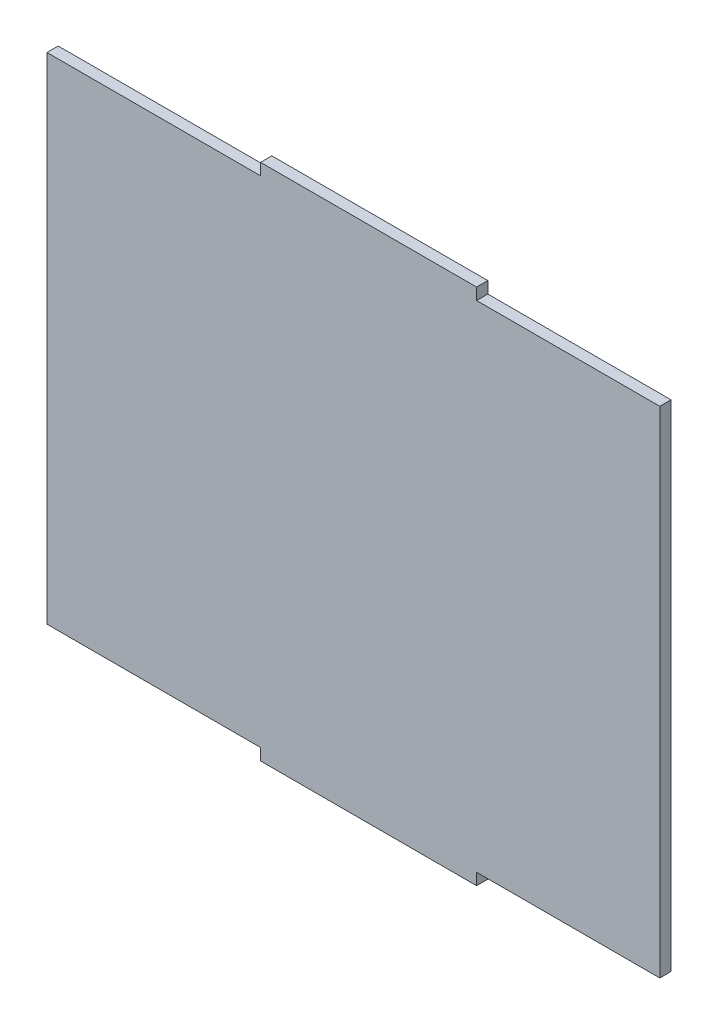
ISO-10303-21;
HEADER;
FILE_DESCRIPTION(('STEP AP214'),'2;1');
FILE_NAME('part.step','',(''),(''),'','','');
FILE_SCHEMA(('AUTOMOTIVE_DESIGN { 1 0 10303 214 1 1 1 1 }'));
ENDSEC;
DATA;
#1=APPLICATION_CONTEXT('core data for automotive mechanical design processes');
#2=APPLICATION_PROTOCOL_DEFINITION('international standard','automotive_design',2000,#1);
#3=PRODUCT_CONTEXT('',#1,'mechanical');
#4=PRODUCT('Part','Part','',(#3));
#5=PRODUCT_RELATED_PRODUCT_CATEGORY('part','',(#4));
#6=PRODUCT_DEFINITION_FORMATION('','',#4);
#7=PRODUCT_DEFINITION_CONTEXT('part definition',#1,'design');
#8=PRODUCT_DEFINITION('design','',#6,#7);
#9=PRODUCT_DEFINITION_SHAPE('','',#8);
#10=(LENGTH_UNIT() NAMED_UNIT(*) SI_UNIT(.MILLI.,.METRE.));
#11=(NAMED_UNIT(*) PLANE_ANGLE_UNIT() SI_UNIT($,.RADIAN.));
#12=(NAMED_UNIT(*) SI_UNIT($,.STERADIAN.) SOLID_ANGLE_UNIT());
#13=UNCERTAINTY_MEASURE_WITH_UNIT(LENGTH_MEASURE(1.E-05),#10,'distance_accuracy_value','');
#14=(GEOMETRIC_REPRESENTATION_CONTEXT(3) GLOBAL_UNCERTAINTY_ASSIGNED_CONTEXT((#13)) GLOBAL_UNIT_ASSIGNED_CONTEXT((#10,
#11,#12)) REPRESENTATION_CONTEXT('',''));
#15=CARTESIAN_POINT('',(0.,0.,0.));
#16=DIRECTION('',(0.,0.,1.));
#17=DIRECTION('',(1.,0.,0.));
#18=AXIS2_PLACEMENT_3D('',#15,#16,#17);
#19=CARTESIAN_POINT('',(103.2781641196,75.1243500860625,2.6));
#20=DIRECTION('',(-1.,0.,0.));
#21=DIRECTION('',(0.,-1.,0.));
#22=AXIS2_PLACEMENT_3D('',#19,#20,#21);
#23=PLANE('',#22);
#24=DIRECTION('',(0.,1.,0.));
#25=VECTOR('',#24,1.);
#26=CARTESIAN_POINT('',(103.2781641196,75.1243500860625,0.));
#27=LINE('',#26,#25);
#28=CARTESIAN_POINT('',(103.2781641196,-39.4756499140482,0.));
#29=VERTEX_POINT('',#28);
#30=CARTESIAN_POINT('',(103.2781641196,75.1243500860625,0.));
#31=VERTEX_POINT('',#30);
#32=EDGE_CURVE('E157',#29,#31,#27,.T.);
#33=ORIENTED_EDGE('',*,*,#32,.T.);
#34=DIRECTION('',(0.,0.,-1.));
#35=VECTOR('',#34,1.);
#36=CARTESIAN_POINT('',(103.2781641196,75.1243500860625,2.6));
#37=LINE('',#36,#35);
#38=CARTESIAN_POINT('',(103.2781641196,75.1243500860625,2.6));
#39=VERTEX_POINT('',#38);
#40=EDGE_CURVE('E45',#39,#31,#37,.T.);
#41=ORIENTED_EDGE('',*,*,#40,.F.);
#42=DIRECTION('',(0.,1.,0.));
#43=VECTOR('',#42,1.);
#44=CARTESIAN_POINT('',(103.2781641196,75.1243500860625,2.6));
#45=LINE('',#44,#43);
#46=CARTESIAN_POINT('',(103.2781641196,-39.4756499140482,2.6));
#47=VERTEX_POINT('',#46);
#48=EDGE_CURVE('E209',#47,#39,#45,.T.);
#49=ORIENTED_EDGE('',*,*,#48,.F.);
#50=DIRECTION('',(0.,0.,-1.));
#51=VECTOR('',#50,1.);
#52=CARTESIAN_POINT('',(103.2781641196,-39.4756499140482,2.6));
#53=LINE('',#52,#51);
#54=EDGE_CURVE('E11',#47,#29,#53,.T.);
#55=ORIENTED_EDGE('',*,*,#54,.T.);
#56=EDGE_LOOP('',(#33,#41,#49,#55));
#57=FACE_BOUND('',#56,.T.);
#58=ADVANCED_FACE('F37',(#57),#23,.F.);
#59=CARTESIAN_POINT('',(60.8771144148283,75.1243500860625,2.6));
#60=DIRECTION('',(0.,-1.,0.));
#61=DIRECTION('',(0.,0.,-1.));
#62=AXIS2_PLACEMENT_3D('',#59,#60,#61);
#63=PLANE('',#62);
#64=DIRECTION('',(-1.,0.,0.));
#65=VECTOR('',#64,1.);
#66=CARTESIAN_POINT('',(60.8771144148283,75.1243500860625,0.));
#67=LINE('',#66,#65);
#68=CARTESIAN_POINT('',(60.8771144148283,75.1243500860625,0.));
#69=VERTEX_POINT('',#68);
#70=EDGE_CURVE('E160',#31,#69,#67,.T.);
#71=ORIENTED_EDGE('',*,*,#70,.T.);
#72=DIRECTION('',(0.,0.,-1.));
#73=VECTOR('',#72,1.);
#74=CARTESIAN_POINT('',(60.8771144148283,75.1243500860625,2.6));
#75=LINE('',#74,#73);
#76=CARTESIAN_POINT('',(60.8771144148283,75.1243500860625,2.6));
#77=VERTEX_POINT('',#76);
#78=EDGE_CURVE('E198',#77,#69,#75,.T.);
#79=ORIENTED_EDGE('',*,*,#78,.F.);
#80=DIRECTION('',(-1.,0.,0.));
#81=VECTOR('',#80,1.);
#82=CARTESIAN_POINT('',(93.369435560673,75.1243500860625,2.6));
#83=LINE('',#82,#81);
#84=EDGE_CURVE('E206',#39,#77,#83,.T.);
#85=ORIENTED_EDGE('',*,*,#84,.F.);
#86=ORIENTED_EDGE('',*,*,#40,.T.);
#87=EDGE_LOOP('',(#71,#79,#85,#86));
#88=FACE_BOUND('',#87,.T.);
#89=ADVANCED_FACE('F204',(#88),#63,.F.);
#90=CARTESIAN_POINT('',(60.8771144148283,77.8243500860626,2.6));
#91=DIRECTION('',(-1.,0.,0.));
#92=DIRECTION('',(0.,0.,1.));
#93=AXIS2_PLACEMENT_3D('',#90,#91,#92);
#94=PLANE('',#93);
#95=DIRECTION('',(0.,1.,0.));
#96=VECTOR('',#95,1.);
#97=CARTESIAN_POINT('',(60.8771144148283,77.8243500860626,0.));
#98=LINE('',#97,#96);
#99=CARTESIAN_POINT('',(60.8771144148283,77.8243500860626,0.));
#100=VERTEX_POINT('',#99);
#101=EDGE_CURVE('E162',#69,#100,#98,.T.);
#102=ORIENTED_EDGE('',*,*,#101,.T.);
#103=DIRECTION('',(0.,0.,-1.));
#104=VECTOR('',#103,1.);
#105=CARTESIAN_POINT('',(60.8771144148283,77.8243500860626,2.6));
#106=LINE('',#105,#104);
#107=CARTESIAN_POINT('',(60.8771144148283,77.8243500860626,2.6));
#108=VERTEX_POINT('',#107);
#109=EDGE_CURVE('E195',#108,#100,#106,.T.);
#110=ORIENTED_EDGE('',*,*,#109,.F.);
#111=DIRECTION('',(0.,1.,0.));
#112=VECTOR('',#111,1.);
#113=CARTESIAN_POINT('',(60.8771144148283,77.8243500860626,2.6));
#114=LINE('',#113,#112);
#115=EDGE_CURVE('E228',#77,#108,#114,.T.);
#116=ORIENTED_EDGE('',*,*,#115,.F.);
#117=ORIENTED_EDGE('',*,*,#78,.T.);
#118=EDGE_LOOP('',(#102,#110,#116,#117));
#119=FACE_BOUND('',#118,.T.);
#120=ADVANCED_FACE('F219',(#119),#94,.F.);
#121=CARTESIAN_POINT('',(60.8771144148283,77.8243500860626,2.6));
#122=DIRECTION('',(0.,-1.,0.));
#123=DIRECTION('',(0.,0.,-1.));
#124=AXIS2_PLACEMENT_3D('',#121,#122,#123);
#125=PLANE('',#124);
#126=DIRECTION('',(-1.,0.,0.));
#127=VECTOR('',#126,1.);
#128=CARTESIAN_POINT('',(60.8771144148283,77.8243500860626,0.));
#129=LINE('',#128,#127);
#130=CARTESIAN_POINT('',(10.8771144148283,77.8243500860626,0.));
#131=VERTEX_POINT('',#130);
#132=EDGE_CURVE('E164',#100,#131,#129,.T.);
#133=ORIENTED_EDGE('',*,*,#132,.T.);
#134=DIRECTION('',(0.,0.,-1.));
#135=VECTOR('',#134,1.);
#136=CARTESIAN_POINT('',(10.8771144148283,77.8243500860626,2.6));
#137=LINE('',#136,#135);
#138=CARTESIAN_POINT('',(10.8771144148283,77.8243500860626,2.6));
#139=VERTEX_POINT('',#138);
#140=EDGE_CURVE('E192',#139,#131,#137,.T.);
#141=ORIENTED_EDGE('',*,*,#140,.F.);
#142=DIRECTION('',(-1.,0.,0.));
#143=VECTOR('',#142,1.);
#144=CARTESIAN_POINT('',(60.8771144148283,77.8243500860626,2.6));
#145=LINE('',#144,#143);
#146=EDGE_CURVE('E225',#108,#139,#145,.T.);
#147=ORIENTED_EDGE('',*,*,#146,.F.);
#148=ORIENTED_EDGE('',*,*,#109,.T.);
#149=EDGE_LOOP('',(#133,#141,#147,#148));
#150=FACE_BOUND('',#149,.T.);
#151=ADVANCED_FACE('F223',(#150),#125,.F.);
#152=CARTESIAN_POINT('',(10.8771144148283,77.8243500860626,2.6));
#153=DIRECTION('',(1.,0.,0.));
#154=DIRECTION('',(0.,0.,-1.));
#155=AXIS2_PLACEMENT_3D('',#152,#153,#154);
#156=PLANE('',#155);
#157=DIRECTION('',(0.,-1.,0.));
#158=VECTOR('',#157,1.);
#159=CARTESIAN_POINT('',(10.8771144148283,77.8243500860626,0.));
#160=LINE('',#159,#158);
#161=CARTESIAN_POINT('',(10.8771144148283,75.1243500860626,0.));
#162=VERTEX_POINT('',#161);
#163=EDGE_CURVE('E166',#131,#162,#160,.T.);
#164=ORIENTED_EDGE('',*,*,#163,.T.);
#165=DIRECTION('',(0.,0.,-1.));
#166=VECTOR('',#165,1.);
#167=CARTESIAN_POINT('',(10.8771144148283,75.1243500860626,2.6));
#168=LINE('',#167,#166);
#169=CARTESIAN_POINT('',(10.8771144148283,75.1243500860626,2.6));
#170=VERTEX_POINT('',#169);
#171=EDGE_CURVE('E189',#170,#162,#168,.T.);
#172=ORIENTED_EDGE('',*,*,#171,.F.);
#173=DIRECTION('',(0.,-1.,0.));
#174=VECTOR('',#173,1.);
#175=CARTESIAN_POINT('',(10.8771144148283,77.8243500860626,2.6));
#176=LINE('',#175,#174);
#177=EDGE_CURVE('E227',#139,#170,#176,.T.);
#178=ORIENTED_EDGE('',*,*,#177,.F.);
#179=ORIENTED_EDGE('',*,*,#140,.T.);
#180=EDGE_LOOP('',(#164,#172,#178,#179));
#181=FACE_BOUND('',#180,.T.);
#182=ADVANCED_FACE('F251',(#181),#156,.F.);
#183=CARTESIAN_POINT('',(-38.5603309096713,75.1243500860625,2.6));
#184=DIRECTION('',(0.,-1.,0.));
#185=DIRECTION('',(1.,0.,0.));
#186=AXIS2_PLACEMENT_3D('',#183,#184,#185);
#187=PLANE('',#186);
#188=DIRECTION('',(-1.,0.,0.));
#189=VECTOR('',#188,1.);
#190=CARTESIAN_POINT('',(-38.5603309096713,75.1243500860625,0.));
#191=LINE('',#190,#189);
#192=CARTESIAN_POINT('',(-38.5603309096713,75.1243500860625,0.));
#193=VERTEX_POINT('',#192);
#194=EDGE_CURVE('E168',#162,#193,#191,.T.);
#195=ORIENTED_EDGE('',*,*,#194,.T.);
#196=DIRECTION('',(0.,0.,-1.));
#197=VECTOR('',#196,1.);
#198=CARTESIAN_POINT('',(-38.5603309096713,75.1243500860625,2.6));
#199=LINE('',#198,#197);
#200=CARTESIAN_POINT('',(-38.5603309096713,75.1243500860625,2.6));
#201=VERTEX_POINT('',#200);
#202=EDGE_CURVE('E186',#201,#193,#199,.T.);
#203=ORIENTED_EDGE('',*,*,#202,.F.);
#204=DIRECTION('',(-1.,0.,0.));
#205=VECTOR('',#204,1.);
#206=CARTESIAN_POINT('',(-38.5603309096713,75.1243500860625,2.6));
#207=LINE('',#206,#205);
#208=EDGE_CURVE('E230',#170,#201,#207,.T.);
#209=ORIENTED_EDGE('',*,*,#208,.F.);
#210=ORIENTED_EDGE('',*,*,#171,.T.);
#211=EDGE_LOOP('',(#195,#203,#209,#210));
#212=FACE_BOUND('',#211,.T.);
#213=ADVANCED_FACE('F248',(#212),#187,.F.);
#214=CARTESIAN_POINT('',(-38.5603309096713,-39.4756499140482,2.6));
#215=DIRECTION('',(1.,0.,0.));
#216=DIRECTION('',(0.,0.,-1.));
#217=AXIS2_PLACEMENT_3D('',#214,#215,#216);
#218=PLANE('',#217);
#219=DIRECTION('',(0.,-1.,0.));
#220=VECTOR('',#219,1.);
#221=CARTESIAN_POINT('',(-38.5603309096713,-39.4756499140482,0.));
#222=LINE('',#221,#220);
#223=CARTESIAN_POINT('',(-38.5603309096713,-39.4756499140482,0.));
#224=VERTEX_POINT('',#223);
#225=EDGE_CURVE('E171',#193,#224,#222,.T.);
#226=ORIENTED_EDGE('',*,*,#225,.T.);
#227=DIRECTION('',(0.,0.,-1.));
#228=VECTOR('',#227,1.);
#229=CARTESIAN_POINT('',(-38.5603309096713,-39.4756499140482,2.6));
#230=LINE('',#229,#228);
#231=CARTESIAN_POINT('',(-38.5603309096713,-39.4756499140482,2.6));
#232=VERTEX_POINT('',#231);
#233=EDGE_CURVE('E183',#232,#224,#230,.T.);
#234=ORIENTED_EDGE('',*,*,#233,.F.);
#235=DIRECTION('',(0.,-1.,0.));
#236=VECTOR('',#235,1.);
#237=CARTESIAN_POINT('',(-38.5603309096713,39.4756499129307,2.6));
#238=LINE('',#237,#236);
#239=EDGE_CURVE('E236',#201,#232,#238,.T.);
#240=ORIENTED_EDGE('',*,*,#239,.F.);
#241=ORIENTED_EDGE('',*,*,#202,.T.);
#242=EDGE_LOOP('',(#226,#234,#240,#241));
#243=FACE_BOUND('',#242,.T.);
#244=ADVANCED_FACE('F242',(#243),#218,.F.);
#245=CARTESIAN_POINT('',(10.8771144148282,-39.4756499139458,2.6));
#246=DIRECTION('',(-2.07209110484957E-12,1.,0.));
#247=DIRECTION('',(-1.,-2.07209110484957E-12,0.));
#248=AXIS2_PLACEMENT_3D('',#245,#246,#247);
#249=PLANE('',#248);
#250=DIRECTION('',(1.,2.07209110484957E-12,0.));
#251=VECTOR('',#250,1.);
#252=CARTESIAN_POINT('',(10.8771144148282,-39.4756499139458,0.));
#253=LINE('',#252,#251);
#254=CARTESIAN_POINT('',(10.8771144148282,-39.4756499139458,0.));
#255=VERTEX_POINT('',#254);
#256=EDGE_CURVE('E173',#224,#255,#253,.T.);
#257=ORIENTED_EDGE('',*,*,#256,.T.);
#258=DIRECTION('',(0.,0.,-1.));
#259=VECTOR('',#258,1.);
#260=CARTESIAN_POINT('',(10.8771144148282,-39.4756499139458,2.6));
#261=LINE('',#260,#259);
#262=CARTESIAN_POINT('',(10.8771144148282,-39.4756499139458,2.6));
#263=VERTEX_POINT('',#262);
#264=EDGE_CURVE('E146',#263,#255,#261,.T.);
#265=ORIENTED_EDGE('',*,*,#264,.F.);
#266=DIRECTION('',(1.,2.07209110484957E-12,0.));
#267=VECTOR('',#266,1.);
#268=CARTESIAN_POINT('',(10.8771144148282,-39.4756499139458,2.6));
#269=LINE('',#268,#267);
#270=EDGE_CURVE('E137',#232,#263,#269,.T.);
#271=ORIENTED_EDGE('',*,*,#270,.F.);
#272=ORIENTED_EDGE('',*,*,#233,.T.);
#273=EDGE_LOOP('',(#257,#265,#271,#272));
#274=FACE_BOUND('',#273,.T.);
#275=ADVANCED_FACE('F245',(#274),#249,.F.);
#276=CARTESIAN_POINT('',(10.8771144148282,-39.4756499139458,2.6));
#277=DIRECTION('',(1.,0.,0.));
#278=DIRECTION('',(0.,0.,-1.));
#279=AXIS2_PLACEMENT_3D('',#276,#277,#278);
#280=PLANE('',#279);
#281=DIRECTION('',(0.,-1.,0.));
#282=VECTOR('',#281,1.);
#283=CARTESIAN_POINT('',(10.8771144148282,-39.4756499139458,0.));
#284=LINE('',#283,#282);
#285=CARTESIAN_POINT('',(10.8771144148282,-42.1756499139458,0.));
#286=VERTEX_POINT('',#285);
#287=EDGE_CURVE('E145',#255,#286,#284,.T.);
#288=ORIENTED_EDGE('',*,*,#287,.T.);
#289=DIRECTION('',(0.,0.,-1.));
#290=VECTOR('',#289,1.);
#291=CARTESIAN_POINT('',(10.8771144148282,-42.1756499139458,2.6));
#292=LINE('',#291,#290);
#293=CARTESIAN_POINT('',(10.8771144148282,-42.1756499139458,2.6));
#294=VERTEX_POINT('',#293);
#295=EDGE_CURVE('E142',#294,#286,#292,.T.);
#296=ORIENTED_EDGE('',*,*,#295,.F.);
#297=DIRECTION('',(0.,-1.,0.));
#298=VECTOR('',#297,1.);
#299=CARTESIAN_POINT('',(10.8771144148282,-39.4756499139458,2.6));
#300=LINE('',#299,#298);
#301=EDGE_CURVE('E131',#263,#294,#300,.T.);
#302=ORIENTED_EDGE('',*,*,#301,.F.);
#303=ORIENTED_EDGE('',*,*,#264,.T.);
#304=EDGE_LOOP('',(#288,#296,#302,#303));
#305=FACE_BOUND('',#304,.T.);
#306=ADVANCED_FACE('F143',(#305),#280,.F.);
#307=CARTESIAN_POINT('',(10.8771144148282,-42.1756499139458,2.6));
#308=DIRECTION('',(0.,1.,0.));
#309=DIRECTION('',(0.,0.,1.));
#310=AXIS2_PLACEMENT_3D('',#307,#308,#309);
#311=PLANE('',#310);
#312=DIRECTION('',(1.,0.,0.));
#313=VECTOR('',#312,1.);
#314=CARTESIAN_POINT('',(10.8771144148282,-42.1756499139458,0.));
#315=LINE('',#314,#313);
#316=CARTESIAN_POINT('',(60.8771144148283,-42.1756499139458,0.));
#317=VERTEX_POINT('',#316);
#318=EDGE_CURVE('E95',#286,#317,#315,.T.);
#319=ORIENTED_EDGE('',*,*,#318,.T.);
#320=DIRECTION('',(0.,0.,-1.));
#321=VECTOR('',#320,1.);
#322=CARTESIAN_POINT('',(60.8771144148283,-42.1756499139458,2.6));
#323=LINE('',#322,#321);
#324=CARTESIAN_POINT('',(60.8771144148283,-42.1756499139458,2.6));
#325=VERTEX_POINT('',#324);
#326=EDGE_CURVE('E147',#325,#317,#323,.T.);
#327=ORIENTED_EDGE('',*,*,#326,.F.);
#328=DIRECTION('',(1.,0.,0.));
#329=VECTOR('',#328,1.);
#330=CARTESIAN_POINT('',(10.8771144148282,-42.1756499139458,2.6));
#331=LINE('',#330,#329);
#332=EDGE_CURVE('E135',#294,#325,#331,.T.);
#333=ORIENTED_EDGE('',*,*,#332,.F.);
#334=ORIENTED_EDGE('',*,*,#295,.T.);
#335=EDGE_LOOP('',(#319,#327,#333,#334));
#336=FACE_BOUND('',#335,.T.);
#337=ADVANCED_FACE('F149',(#336),#311,.F.);
#338=CARTESIAN_POINT('',(60.8771144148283,-39.4756499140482,2.6));
#339=DIRECTION('',(-1.,0.,0.));
#340=DIRECTION('',(0.,-1.,0.));
#341=AXIS2_PLACEMENT_3D('',#338,#339,#340);
#342=PLANE('',#341);
#343=DIRECTION('',(0.,1.,0.));
#344=VECTOR('',#343,1.);
#345=CARTESIAN_POINT('',(60.8771144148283,-39.4756499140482,0.));
#346=LINE('',#345,#344);
#347=CARTESIAN_POINT('',(60.8771144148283,-39.4756499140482,0.));
#348=VERTEX_POINT('',#347);
#349=EDGE_CURVE('E102',#317,#348,#346,.T.);
#350=ORIENTED_EDGE('',*,*,#349,.T.);
#351=DIRECTION('',(0.,0.,-1.));
#352=VECTOR('',#351,1.);
#353=CARTESIAN_POINT('',(60.8771144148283,-39.4756499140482,2.6));
#354=LINE('',#353,#352);
#355=CARTESIAN_POINT('',(60.8771144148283,-39.4756499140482,2.6));
#356=VERTEX_POINT('',#355);
#357=EDGE_CURVE('E153',#356,#348,#354,.T.);
#358=ORIENTED_EDGE('',*,*,#357,.F.);
#359=DIRECTION('',(0.,1.,0.));
#360=VECTOR('',#359,1.);
#361=CARTESIAN_POINT('',(60.8771144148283,-39.4756499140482,2.6));
#362=LINE('',#361,#360);
#363=EDGE_CURVE('E151',#325,#356,#362,.T.);
#364=ORIENTED_EDGE('',*,*,#363,.F.);
#365=ORIENTED_EDGE('',*,*,#326,.T.);
#366=EDGE_LOOP('',(#350,#358,#364,#365));
#367=FACE_BOUND('',#366,.T.);
#368=ADVANCED_FACE('F318',(#367),#342,.F.);
#369=CARTESIAN_POINT('',(78.8396690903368,-39.4756499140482,2.6));
#370=DIRECTION('',(0.,1.,0.));
#371=DIRECTION('',(0.,0.,1.));
#372=AXIS2_PLACEMENT_3D('',#369,#370,#371);
#373=PLANE('',#372);
#374=DIRECTION('',(1.,0.,0.));
#375=VECTOR('',#374,1.);
#376=CARTESIAN_POINT('',(78.8396690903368,-39.4756499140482,0.));
#377=LINE('',#376,#375);
#378=EDGE_CURVE('E178',#348,#29,#377,.T.);
#379=ORIENTED_EDGE('',*,*,#378,.T.);
#380=ORIENTED_EDGE('',*,*,#54,.F.);
#381=DIRECTION('',(1.,0.,0.));
#382=VECTOR('',#381,1.);
#383=CARTESIAN_POINT('',(78.8396690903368,-39.4756499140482,2.6));
#384=LINE('',#383,#382);
#385=EDGE_CURVE('E53',#356,#47,#384,.T.);
#386=ORIENTED_EDGE('',*,*,#385,.F.);
#387=ORIENTED_EDGE('',*,*,#357,.T.);
#388=EDGE_LOOP('',(#379,#380,#386,#387));
#389=FACE_BOUND('',#388,.T.);
#390=ADVANCED_FACE('F327',(#389),#373,.F.);
#391=CARTESIAN_POINT('',(0.,0.,2.6));
#392=DIRECTION('',(0.,0.,-1.));
#393=DIRECTION('',(-1.,0.,0.));
#394=AXIS2_PLACEMENT_3D('',#391,#392,#393);
#395=PLANE('',#394);
#396=ORIENTED_EDGE('',*,*,#385,.T.);
#397=ORIENTED_EDGE('',*,*,#48,.T.);
#398=ORIENTED_EDGE('',*,*,#84,.T.);
#399=ORIENTED_EDGE('',*,*,#115,.T.);
#400=ORIENTED_EDGE('',*,*,#146,.T.);
#401=ORIENTED_EDGE('',*,*,#177,.T.);
#402=ORIENTED_EDGE('',*,*,#208,.T.);
#403=ORIENTED_EDGE('',*,*,#239,.T.);
#404=ORIENTED_EDGE('',*,*,#270,.T.);
#405=ORIENTED_EDGE('',*,*,#301,.T.);
#406=ORIENTED_EDGE('',*,*,#332,.T.);
#407=ORIENTED_EDGE('',*,*,#363,.T.);
#408=EDGE_LOOP('',(#396,#397,#398,#399,#400,#401,#402,#403,#404,#405,#406,#407));
#409=FACE_BOUND('',#408,.T.);
#410=ADVANCED_FACE('F133',(#409),#395,.F.);
#411=CARTESIAN_POINT('',(0.,0.,0.));
#412=DIRECTION('',(0.,0.,-1.));
#413=DIRECTION('',(-1.,0.,0.));
#414=AXIS2_PLACEMENT_3D('',#411,#412,#413);
#415=PLANE('',#414);
#416=ORIENTED_EDGE('',*,*,#32,.F.);
#417=ORIENTED_EDGE('',*,*,#378,.F.);
#418=ORIENTED_EDGE('',*,*,#349,.F.);
#419=ORIENTED_EDGE('',*,*,#318,.F.);
#420=ORIENTED_EDGE('',*,*,#287,.F.);
#421=ORIENTED_EDGE('',*,*,#256,.F.);
#422=ORIENTED_EDGE('',*,*,#225,.F.);
#423=ORIENTED_EDGE('',*,*,#194,.F.);
#424=ORIENTED_EDGE('',*,*,#163,.F.);
#425=ORIENTED_EDGE('',*,*,#132,.F.);
#426=ORIENTED_EDGE('',*,*,#101,.F.);
#427=ORIENTED_EDGE('',*,*,#70,.F.);
#428=EDGE_LOOP('',(#416,#417,#418,#419,#420,#421,#422,#423,#424,#425,#426,#427));
#429=FACE_BOUND('',#428,.T.);
#430=ADVANCED_FACE('F213',(#429),#415,.T.);
#431=CLOSED_SHELL('',(#58,#89,#120,#151,#182,#213,#244,#275,#306,#337,#368,#390,#410,#430));
#432=MANIFOLD_SOLID_BREP('B2',#431);
#433=ADVANCED_BREP_SHAPE_REPRESENTATION('',(#18,#432),#14);
#434=SHAPE_DEFINITION_REPRESENTATION(#9,#433);
ENDSEC;
END-ISO-10303-21;
